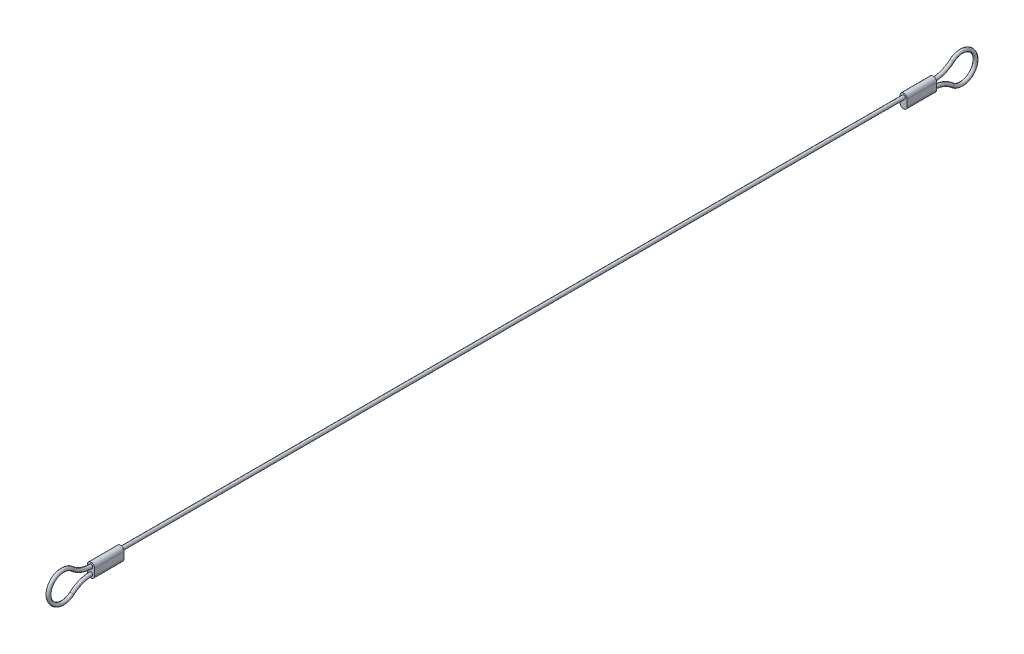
from build123d import *

# Parameters (mm, degrees)
SKETCH2_R           = 0.595
BOSS_EXTRUDE1_DEPTH = 10


with BuildPart() as part:
    # Sweep1: sweep along a path in Sketch1
    with BuildLine(Plane(origin=(0, 0, 0), x_dir=(0, 0, -1), z_dir=(1, 0, 0))) as sweep1_path:
        ThreePointArc((-142.8, -2.266252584), (-146.225492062, -2.898197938), (-149.2, -4.710835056))
        ThreePointArc((-149.2, -4.710835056), (-157.2, -1.133126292), (-149.2, 2.444582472))
        ThreePointArc((-149.2, 2.444582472), (-146.225492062, 0.631945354), (-142.8, 0))
        Line((-142.8, 0), (142.8, 0))
        ThreePointArc((142.8, 0), (146.225492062, 0.631945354), (149.2, 2.444582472))
        ThreePointArc((149.2, 2.444582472), (157.2, -1.133126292), (149.2, -4.710835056))
        ThreePointArc((149.2, -4.710835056), (146.225492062, -2.898197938), (142.8, -2.266252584))
    # Sketch2 → Sweep1 (sweep)
    with BuildSketch(Plane.XY):
        Circle(SKETCH2_R)
    sweep(path=sweep1_path.line)

    # Sketch3 → Boss-Extrude1 (add)
    with BuildSketch(Plane(origin=(0, 0, 142.8), x_dir=(-1, 0, 0), z_dir=(0, 0, -1))):
        with BuildLine():
            Line((1.2, 0), (1.2, -2.266252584))
            ThreePointArc((1.2, -2.266252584), (0, -3.466252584), (-1.2, -2.266252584))
            Line((-1.2, -2.266252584), (-1.2, 0))
            ThreePointArc((-1.2, 0), (0, 1.2), (1.2, 0))
        make_face()
    boss_extrude1 = extrude(amount=BOSS_EXTRUDE1_DEPTH)

    # Mirror1: Boss-Extrude1 across plane
    add(boss_extrude1.mirror(Plane.XY))


solid = part.part
